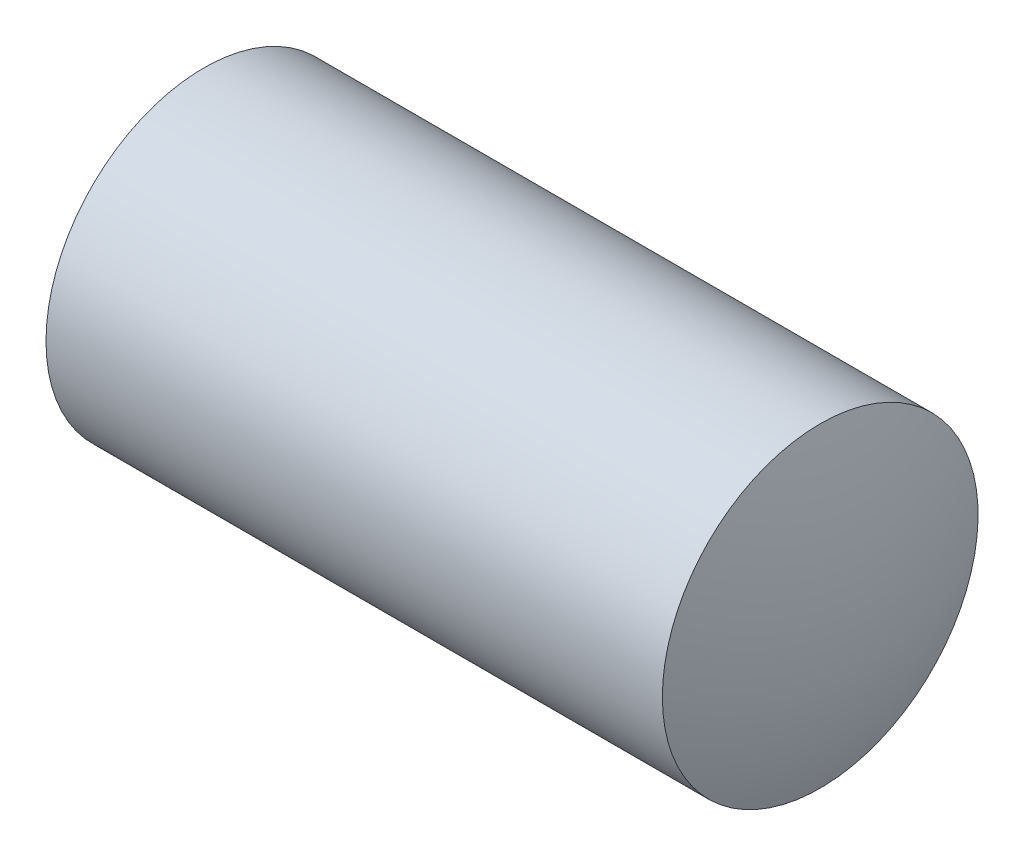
ISO-10303-21;
HEADER;
FILE_DESCRIPTION(('STEP AP214'),'2;1');
FILE_NAME('part.step','',(''),(''),'','','');
FILE_SCHEMA(('AUTOMOTIVE_DESIGN { 1 0 10303 214 1 1 1 1 }'));
ENDSEC;
DATA;
#1=APPLICATION_CONTEXT('core data for automotive mechanical design processes');
#2=APPLICATION_PROTOCOL_DEFINITION('international standard','automotive_design',2000,#1);
#3=PRODUCT_CONTEXT('',#1,'mechanical');
#4=PRODUCT('Part','Part','',(#3));
#5=PRODUCT_RELATED_PRODUCT_CATEGORY('part','',(#4));
#6=PRODUCT_DEFINITION_FORMATION('','',#4);
#7=PRODUCT_DEFINITION_CONTEXT('part definition',#1,'design');
#8=PRODUCT_DEFINITION('design','',#6,#7);
#9=PRODUCT_DEFINITION_SHAPE('','',#8);
#10=(LENGTH_UNIT() NAMED_UNIT(*) SI_UNIT(.MILLI.,.METRE.));
#11=(NAMED_UNIT(*) PLANE_ANGLE_UNIT() SI_UNIT($,.RADIAN.));
#12=(NAMED_UNIT(*) SI_UNIT($,.STERADIAN.) SOLID_ANGLE_UNIT());
#13=UNCERTAINTY_MEASURE_WITH_UNIT(LENGTH_MEASURE(1.E-05),#10,'distance_accuracy_value','');
#14=(GEOMETRIC_REPRESENTATION_CONTEXT(3) GLOBAL_UNCERTAINTY_ASSIGNED_CONTEXT((#13)) GLOBAL_UNIT_ASSIGNED_CONTEXT((#10,
#11,#12)) REPRESENTATION_CONTEXT('',''));
#15=CARTESIAN_POINT('',(0.,0.,0.));
#16=DIRECTION('',(0.,0.,1.));
#17=DIRECTION('',(1.,0.,0.));
#18=AXIS2_PLACEMENT_3D('',#15,#16,#17);
#19=CARTESIAN_POINT('',(0.,0.,0.));
#20=DIRECTION('',(-1.,0.,0.));
#21=DIRECTION('',(0.,0.,1.));
#22=AXIS2_PLACEMENT_3D('',#19,#20,#21);
#23=PLANE('',#22);
#24=CARTESIAN_POINT('',(0.,0.,0.));
#25=DIRECTION('',(-1.,0.,0.));
#26=DIRECTION('',(0.,0.,1.));
#27=AXIS2_PLACEMENT_3D('',#24,#25,#26);
#28=CIRCLE('',#27,10.352);
#29=CARTESIAN_POINT('',(0.,0.,10.352));
#30=VERTEX_POINT('',#29);
#31=EDGE_CURVE('E137',#30,#30,#28,.T.);
#32=ORIENTED_EDGE('',*,*,#31,.T.);
#33=EDGE_LOOP('',(#32));
#34=FACE_BOUND('',#33,.T.);
#35=DIRECTION('',(0.,0.,-1.));
#36=VECTOR('',#35,1.);
#37=CARTESIAN_POINT('',(0.,6.,3.46410161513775));
#38=LINE('',#37,#36);
#39=CARTESIAN_POINT('',(0.,6.,3.46410161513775));
#40=VERTEX_POINT('',#39);
#41=CARTESIAN_POINT('',(0.,6.,-3.46410161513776));
#42=VERTEX_POINT('',#41);
#43=EDGE_CURVE('E128',#40,#42,#38,.T.);
#44=ORIENTED_EDGE('',*,*,#43,.F.);
#45=DIRECTION('',(0.,-0.866025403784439,0.5));
#46=VECTOR('',#45,1.);
#47=CARTESIAN_POINT('',(0.,6.,3.46410161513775));
#48=LINE('',#47,#46);
#49=CARTESIAN_POINT('',(0.,0.,6.9282032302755));
#50=VERTEX_POINT('',#49);
#51=EDGE_CURVE('E50',#40,#50,#48,.T.);
#52=ORIENTED_EDGE('',*,*,#51,.T.);
#53=DIRECTION('',(0.,0.866025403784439,0.5));
#54=VECTOR('',#53,1.);
#55=CARTESIAN_POINT('',(0.,-5.99999999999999,3.46410161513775));
#56=LINE('',#55,#54);
#57=CARTESIAN_POINT('',(0.,-5.99999999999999,3.46410161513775));
#58=VERTEX_POINT('',#57);
#59=EDGE_CURVE('E119',#58,#50,#56,.T.);
#60=ORIENTED_EDGE('',*,*,#59,.F.);
#61=DIRECTION('',(0.,0.,-1.));
#62=VECTOR('',#61,1.);
#63=CARTESIAN_POINT('',(0.,-5.99999999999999,3.46410161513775));
#64=LINE('',#63,#62);
#65=CARTESIAN_POINT('',(0.,-5.99999999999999,-3.46410161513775));
#66=VERTEX_POINT('',#65);
#67=EDGE_CURVE('E122',#58,#66,#64,.T.);
#68=ORIENTED_EDGE('',*,*,#67,.T.);
#69=DIRECTION('',(0.,0.866025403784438,-0.5));
#70=VECTOR('',#69,1.);
#71=CARTESIAN_POINT('',(0.,-5.99999999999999,-3.46410161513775));
#72=LINE('',#71,#70);
#73=CARTESIAN_POINT('',(0.,0.,-6.92820323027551));
#74=VERTEX_POINT('',#73);
#75=EDGE_CURVE('E125',#66,#74,#72,.T.);
#76=ORIENTED_EDGE('',*,*,#75,.T.);
#77=DIRECTION('',(0.,-0.866025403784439,-0.5));
#78=VECTOR('',#77,1.);
#79=CARTESIAN_POINT('',(0.,6.,-3.46410161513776));
#80=LINE('',#79,#78);
#81=EDGE_CURVE('E108',#42,#74,#80,.T.);
#82=ORIENTED_EDGE('',*,*,#81,.F.);
#83=EDGE_LOOP('',(#44,#52,#60,#68,#76,#82));
#84=FACE_BOUND('',#83,.T.);
#85=ADVANCED_FACE('F35',(#34,#84),#23,.T.);
#86=CARTESIAN_POINT('',(16.,0.,0.));
#87=DIRECTION('',(-1.,0.,0.));
#88=DIRECTION('',(0.,1.,0.));
#89=AXIS2_PLACEMENT_3D('',#86,#87,#88);
#90=SPHERICAL_SURFACE('',#89,34.);
#91=CARTESIAN_POINT('',(47.8119474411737,0.,0.));
#92=DIRECTION('',(-1.,0.,0.));
#93=DIRECTION('',(0.,0.,1.));
#94=AXIS2_PLACEMENT_3D('',#91,#92,#93);
#95=CIRCLE('',#94,12.);
#96=CARTESIAN_POINT('',(47.8119474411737,0.,12.));
#97=VERTEX_POINT('',#96);
#98=EDGE_CURVE('E11',#97,#97,#95,.T.);
#99=ORIENTED_EDGE('',*,*,#98,.F.);
#100=EDGE_LOOP('',(#99));
#101=FACE_BOUND('',#100,.T.);
#102=ADVANCED_FACE('F37',(#101),#90,.T.);
#103=CARTESIAN_POINT('',(-12.7,0.,0.));
#104=DIRECTION('',(-1.,0.,0.));
#105=DIRECTION('',(0.,0.,1.));
#106=AXIS2_PLACEMENT_3D('',#103,#104,#105);
#107=CYLINDRICAL_SURFACE('',#106,12.);
#108=ORIENTED_EDGE('',*,*,#98,.T.);
#109=EDGE_LOOP('',(#108));
#110=FACE_BOUND('',#109,.T.);
#111=CARTESIAN_POINT('',(0.951473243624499,0.,0.));
#112=DIRECTION('',(-1.,0.,0.));
#113=DIRECTION('',(0.,0.,1.));
#114=AXIS2_PLACEMENT_3D('',#111,#112,#113);
#115=CIRCLE('',#114,12.);
#116=CARTESIAN_POINT('',(0.951473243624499,0.,12.));
#117=VERTEX_POINT('',#116);
#118=EDGE_CURVE('E43',#117,#117,#115,.T.);
#119=ORIENTED_EDGE('',*,*,#118,.F.);
#120=EDGE_LOOP('',(#119));
#121=FACE_BOUND('',#120,.T.);
#122=ADVANCED_FACE('F145',(#110,#121),#107,.T.);
#123=CARTESIAN_POINT('',(0.,0.,0.));
#124=DIRECTION('',(1.,0.,0.));
#125=DIRECTION('',(0.,0.,-1.));
#126=AXIS2_PLACEMENT_3D('',#123,#124,#125);
#127=CONICAL_SURFACE('',#126,10.352,1.0471975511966);
#128=ORIENTED_EDGE('',*,*,#118,.T.);
#129=EDGE_LOOP('',(#128));
#130=FACE_BOUND('',#129,.T.);
#131=ORIENTED_EDGE('',*,*,#31,.F.);
#132=EDGE_LOOP('',(#131));
#133=FACE_BOUND('',#132,.T.);
#134=ADVANCED_FACE('F142',(#130,#133),#127,.T.);
#135=CARTESIAN_POINT('',(15.,6.,3.46410161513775));
#136=DIRECTION('',(0.,-0.5,-0.866025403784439));
#137=DIRECTION('',(0.,0.866025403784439,-0.5));
#138=AXIS2_PLACEMENT_3D('',#135,#136,#137);
#139=PLANE('',#138);
#140=ORIENTED_EDGE('',*,*,#51,.F.);
#141=DIRECTION('',(-1.,0.,0.));
#142=VECTOR('',#141,1.);
#143=CARTESIAN_POINT('',(15.,6.,3.46410161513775));
#144=LINE('',#143,#142);
#145=CARTESIAN_POINT('',(15.,6.,3.46410161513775));
#146=VERTEX_POINT('',#145);
#147=EDGE_CURVE('E55',#146,#40,#144,.T.);
#148=ORIENTED_EDGE('',*,*,#147,.F.);
#149=DIRECTION('',(0.,-0.866025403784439,0.5));
#150=VECTOR('',#149,1.);
#151=CARTESIAN_POINT('',(15.,6.,3.46410161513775));
#152=LINE('',#151,#150);
#153=CARTESIAN_POINT('',(15.,0.,6.9282032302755));
#154=VERTEX_POINT('',#153);
#155=EDGE_CURVE('E82',#146,#154,#152,.T.);
#156=ORIENTED_EDGE('',*,*,#155,.T.);
#157=DIRECTION('',(-1.,0.,0.));
#158=VECTOR('',#157,1.);
#159=CARTESIAN_POINT('',(15.,0.,6.9282032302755));
#160=LINE('',#159,#158);
#161=EDGE_CURVE('E135',#154,#50,#160,.T.);
#162=ORIENTED_EDGE('',*,*,#161,.T.);
#163=EDGE_LOOP('',(#140,#148,#156,#162));
#164=FACE_BOUND('',#163,.T.);
#165=ADVANCED_FACE('F152',(#164),#139,.T.);
#166=CARTESIAN_POINT('',(15.,-5.99999999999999,3.46410161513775));
#167=DIRECTION('',(0.,-0.5,0.866025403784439));
#168=DIRECTION('',(0.,-0.866025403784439,-0.5));
#169=AXIS2_PLACEMENT_3D('',#166,#167,#168);
#170=PLANE('',#169);
#171=ORIENTED_EDGE('',*,*,#59,.T.);
#172=ORIENTED_EDGE('',*,*,#161,.F.);
#173=DIRECTION('',(0.,0.866025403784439,0.5));
#174=VECTOR('',#173,1.);
#175=CARTESIAN_POINT('',(15.,-5.99999999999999,3.46410161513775));
#176=LINE('',#175,#174);
#177=CARTESIAN_POINT('',(15.,-5.99999999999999,3.46410161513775));
#178=VERTEX_POINT('',#177);
#179=EDGE_CURVE('E250',#178,#154,#176,.T.);
#180=ORIENTED_EDGE('',*,*,#179,.F.);
#181=DIRECTION('',(-1.,0.,0.));
#182=VECTOR('',#181,1.);
#183=CARTESIAN_POINT('',(15.,-5.99999999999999,3.46410161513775));
#184=LINE('',#183,#182);
#185=EDGE_CURVE('E133',#178,#58,#184,.T.);
#186=ORIENTED_EDGE('',*,*,#185,.T.);
#187=EDGE_LOOP('',(#171,#172,#180,#186));
#188=FACE_BOUND('',#187,.T.);
#189=ADVANCED_FACE('F164',(#188),#170,.F.);
#190=CARTESIAN_POINT('',(15.,-5.99999999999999,3.46410161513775));
#191=DIRECTION('',(0.,1.,0.));
#192=DIRECTION('',(0.,0.,1.));
#193=AXIS2_PLACEMENT_3D('',#190,#191,#192);
#194=PLANE('',#193);
#195=ORIENTED_EDGE('',*,*,#67,.F.);
#196=ORIENTED_EDGE('',*,*,#185,.F.);
#197=DIRECTION('',(0.,0.,-1.));
#198=VECTOR('',#197,1.);
#199=CARTESIAN_POINT('',(15.,-5.99999999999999,3.46410161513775));
#200=LINE('',#199,#198);
#201=CARTESIAN_POINT('',(15.,-5.99999999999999,-3.46410161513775));
#202=VERTEX_POINT('',#201);
#203=EDGE_CURVE('E103',#178,#202,#200,.T.);
#204=ORIENTED_EDGE('',*,*,#203,.T.);
#205=DIRECTION('',(-1.,0.,0.));
#206=VECTOR('',#205,1.);
#207=CARTESIAN_POINT('',(15.,-5.99999999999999,-3.46410161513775));
#208=LINE('',#207,#206);
#209=EDGE_CURVE('E98',#202,#66,#208,.T.);
#210=ORIENTED_EDGE('',*,*,#209,.T.);
#211=EDGE_LOOP('',(#195,#196,#204,#210));
#212=FACE_BOUND('',#211,.T.);
#213=ADVANCED_FACE('F167',(#212),#194,.T.);
#214=CARTESIAN_POINT('',(15.,-5.99999999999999,-3.46410161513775));
#215=DIRECTION('',(0.,0.5,0.866025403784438));
#216=DIRECTION('',(0.,-0.866025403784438,0.5));
#217=AXIS2_PLACEMENT_3D('',#214,#215,#216);
#218=PLANE('',#217);
#219=ORIENTED_EDGE('',*,*,#75,.F.);
#220=ORIENTED_EDGE('',*,*,#209,.F.);
#221=DIRECTION('',(0.,0.866025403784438,-0.5));
#222=VECTOR('',#221,1.);
#223=CARTESIAN_POINT('',(15.,-5.99999999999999,-3.46410161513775));
#224=LINE('',#223,#222);
#225=CARTESIAN_POINT('',(15.,0.,-6.92820323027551));
#226=VERTEX_POINT('',#225);
#227=EDGE_CURVE('E93',#202,#226,#224,.T.);
#228=ORIENTED_EDGE('',*,*,#227,.T.);
#229=DIRECTION('',(-1.,0.,0.));
#230=VECTOR('',#229,1.);
#231=CARTESIAN_POINT('',(15.,0.,-6.92820323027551));
#232=LINE('',#231,#230);
#233=EDGE_CURVE('E97',#226,#74,#232,.T.);
#234=ORIENTED_EDGE('',*,*,#233,.T.);
#235=EDGE_LOOP('',(#219,#220,#228,#234));
#236=FACE_BOUND('',#235,.T.);
#237=ADVANCED_FACE('F96',(#236),#218,.T.);
#238=CARTESIAN_POINT('',(15.,6.,-3.46410161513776));
#239=DIRECTION('',(0.,0.5,-0.866025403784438));
#240=DIRECTION('',(0.,0.866025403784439,0.5));
#241=AXIS2_PLACEMENT_3D('',#238,#239,#240);
#242=PLANE('',#241);
#243=ORIENTED_EDGE('',*,*,#81,.T.);
#244=ORIENTED_EDGE('',*,*,#233,.F.);
#245=DIRECTION('',(0.,-0.866025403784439,-0.5));
#246=VECTOR('',#245,1.);
#247=CARTESIAN_POINT('',(15.,6.,-3.46410161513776));
#248=LINE('',#247,#246);
#249=CARTESIAN_POINT('',(15.,6.,-3.46410161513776));
#250=VERTEX_POINT('',#249);
#251=EDGE_CURVE('E102',#250,#226,#248,.T.);
#252=ORIENTED_EDGE('',*,*,#251,.F.);
#253=DIRECTION('',(-1.,0.,0.));
#254=VECTOR('',#253,1.);
#255=CARTESIAN_POINT('',(15.,6.,-3.46410161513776));
#256=LINE('',#255,#254);
#257=EDGE_CURVE('E78',#250,#42,#256,.T.);
#258=ORIENTED_EDGE('',*,*,#257,.T.);
#259=EDGE_LOOP('',(#243,#244,#252,#258));
#260=FACE_BOUND('',#259,.T.);
#261=ADVANCED_FACE('F105',(#260),#242,.F.);
#262=CARTESIAN_POINT('',(15.,6.,3.46410161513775));
#263=DIRECTION('',(0.,1.,0.));
#264=DIRECTION('',(0.,0.,1.));
#265=AXIS2_PLACEMENT_3D('',#262,#263,#264);
#266=PLANE('',#265);
#267=ORIENTED_EDGE('',*,*,#43,.T.);
#268=ORIENTED_EDGE('',*,*,#257,.F.);
#269=DIRECTION('',(0.,0.,-1.));
#270=VECTOR('',#269,1.);
#271=CARTESIAN_POINT('',(15.,6.,3.46410161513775));
#272=LINE('',#271,#270);
#273=EDGE_CURVE('E113',#146,#250,#272,.T.);
#274=ORIENTED_EDGE('',*,*,#273,.F.);
#275=ORIENTED_EDGE('',*,*,#147,.T.);
#276=EDGE_LOOP('',(#267,#268,#274,#275));
#277=FACE_BOUND('',#276,.T.);
#278=ADVANCED_FACE('F176',(#277),#266,.F.);
#279=CARTESIAN_POINT('',(15.,12.,0.));
#280=DIRECTION('',(1.,0.,0.));
#281=DIRECTION('',(0.,0.,-1.));
#282=AXIS2_PLACEMENT_3D('',#279,#280,#281);
#283=PLANE('',#282);
#284=ORIENTED_EDGE('',*,*,#155,.F.);
#285=ORIENTED_EDGE('',*,*,#273,.T.);
#286=ORIENTED_EDGE('',*,*,#251,.T.);
#287=ORIENTED_EDGE('',*,*,#227,.F.);
#288=ORIENTED_EDGE('',*,*,#203,.F.);
#289=ORIENTED_EDGE('',*,*,#179,.T.);
#290=EDGE_LOOP('',(#284,#285,#286,#287,#288,#289));
#291=FACE_BOUND('',#290,.T.);
#292=ADVANCED_FACE('F111',(#291),#283,.F.);
#293=CLOSED_SHELL('',(#85,#102,#122,#134,#165,#189,#213,#237,#261,#278,#292));
#294=MANIFOLD_SOLID_BREP('B2',#293);
#295=ADVANCED_BREP_SHAPE_REPRESENTATION('',(#18,#294),#14);
#296=SHAPE_DEFINITION_REPRESENTATION(#9,#295);
ENDSEC;
END-ISO-10303-21;
